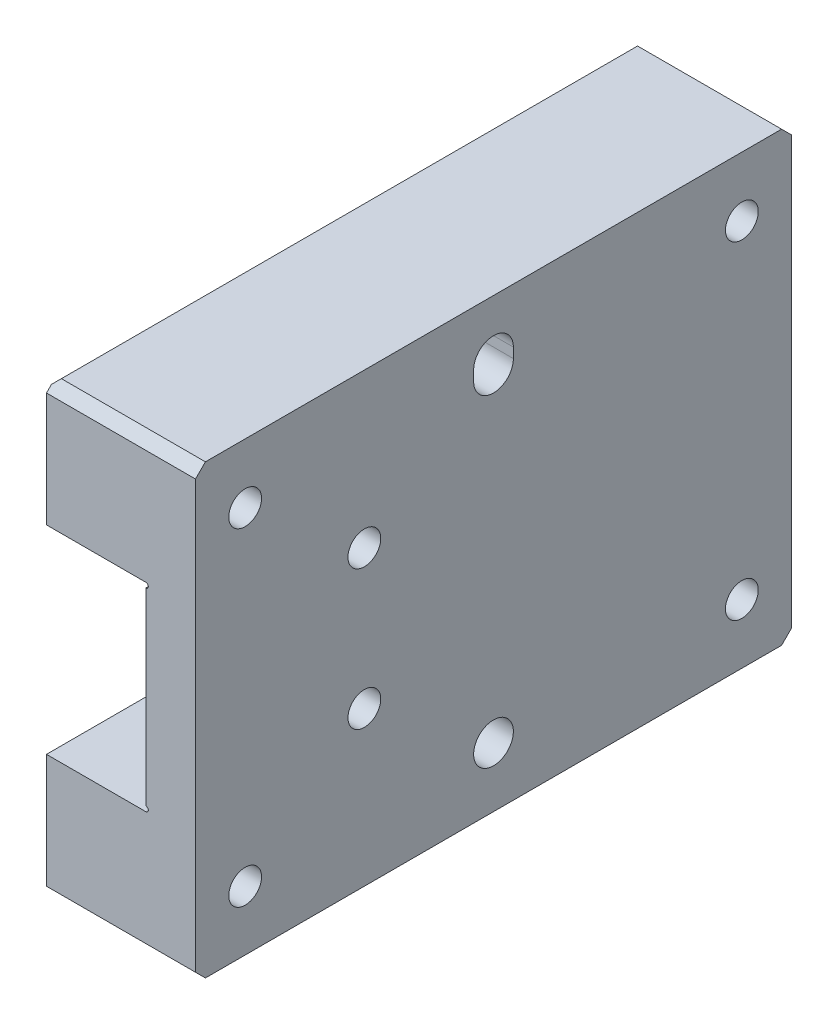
ISO-10303-21;
HEADER;
FILE_DESCRIPTION(('STEP AP214'),'2;1');
FILE_NAME('part.step','',(''),(''),'','','');
FILE_SCHEMA(('AUTOMOTIVE_DESIGN { 1 0 10303 214 1 1 1 1 }'));
ENDSEC;
DATA;
#1=APPLICATION_CONTEXT('core data for automotive mechanical design processes');
#2=APPLICATION_PROTOCOL_DEFINITION('international standard','automotive_design',2000,#1);
#3=PRODUCT_CONTEXT('',#1,'mechanical');
#4=PRODUCT('Part','Part','',(#3));
#5=PRODUCT_RELATED_PRODUCT_CATEGORY('part','',(#4));
#6=PRODUCT_DEFINITION_FORMATION('','',#4);
#7=PRODUCT_DEFINITION_CONTEXT('part definition',#1,'design');
#8=PRODUCT_DEFINITION('design','',#6,#7);
#9=PRODUCT_DEFINITION_SHAPE('','',#8);
#10=(LENGTH_UNIT() NAMED_UNIT(*) SI_UNIT(.MILLI.,.METRE.));
#11=(NAMED_UNIT(*) PLANE_ANGLE_UNIT() SI_UNIT($,.RADIAN.));
#12=(NAMED_UNIT(*) SI_UNIT($,.STERADIAN.) SOLID_ANGLE_UNIT());
#13=UNCERTAINTY_MEASURE_WITH_UNIT(LENGTH_MEASURE(1.E-05),#10,'distance_accuracy_value','');
#14=(GEOMETRIC_REPRESENTATION_CONTEXT(3) GLOBAL_UNCERTAINTY_ASSIGNED_CONTEXT((#13)) GLOBAL_UNIT_ASSIGNED_CONTEXT((#10,
#11,#12)) REPRESENTATION_CONTEXT('',''));
#15=CARTESIAN_POINT('',(0.,0.,0.));
#16=DIRECTION('',(0.,0.,1.));
#17=DIRECTION('',(1.,0.,0.));
#18=AXIS2_PLACEMENT_3D('',#15,#16,#17);
#19=CARTESIAN_POINT('',(-7.5,-22.5,60.));
#20=DIRECTION('',(1.,0.,0.));
#21=DIRECTION('',(0.,0.,-1.));
#22=AXIS2_PLACEMENT_3D('',#19,#20,#21);
#23=PLANE('',#22);
#24=CARTESIAN_POINT('',(-7.5,-16.5,30.));
#25=DIRECTION('',(1.,0.,0.));
#26=DIRECTION('',(0.,0.,-1.));
#27=AXIS2_PLACEMENT_3D('',#24,#25,#26);
#28=CIRCLE('',#27,2.);
#29=CARTESIAN_POINT('',(-7.5,-16.5,28.));
#30=VERTEX_POINT('',#29);
#31=EDGE_CURVE('E224',#30,#30,#28,.T.);
#32=ORIENTED_EDGE('',*,*,#31,.T.);
#33=EDGE_LOOP('',(#32));
#34=FACE_BOUND('',#33,.T.);
#35=CARTESIAN_POINT('',(-7.5,-16.5,55.));
#36=DIRECTION('',(1.,0.,0.));
#37=DIRECTION('',(0.,0.,-1.));
#38=AXIS2_PLACEMENT_3D('',#35,#36,#37);
#39=CIRCLE('',#38,1.65);
#40=CARTESIAN_POINT('',(-7.5,-16.5,53.35));
#41=VERTEX_POINT('',#40);
#42=EDGE_CURVE('E242',#41,#41,#39,.T.);
#43=ORIENTED_EDGE('',*,*,#42,.T.);
#44=EDGE_LOOP('',(#43));
#45=FACE_BOUND('',#44,.T.);
#46=CARTESIAN_POINT('',(-7.5,-16.5,5.));
#47=DIRECTION('',(1.,0.,0.));
#48=DIRECTION('',(0.,0.,-1.));
#49=AXIS2_PLACEMENT_3D('',#46,#47,#48);
#50=CIRCLE('',#49,1.65);
#51=CARTESIAN_POINT('',(-7.5,-16.5,3.35000000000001));
#52=VERTEX_POINT('',#51);
#53=EDGE_CURVE('E248',#52,#52,#50,.T.);
#54=ORIENTED_EDGE('',*,*,#53,.T.);
#55=EDGE_LOOP('',(#54));
#56=FACE_BOUND('',#55,.T.);
#57=DIRECTION('',(0.,-1.,0.));
#58=VECTOR('',#57,1.);
#59=CARTESIAN_POINT('',(-7.5,-22.5,0.));
#60=LINE('',#59,#58);
#61=CARTESIAN_POINT('',(-7.5,-10.,0.));
#62=VERTEX_POINT('',#61);
#63=CARTESIAN_POINT('',(-7.5,-21.5,0.));
#64=VERTEX_POINT('',#63);
#65=EDGE_CURVE('E297',#62,#64,#60,.T.);
#66=ORIENTED_EDGE('',*,*,#65,.T.);
#67=DIRECTION('',(0.,-0.707106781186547,0.707106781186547));
#68=VECTOR('',#67,1.);
#69=CARTESIAN_POINT('',(-7.5,-22.5,1.00000000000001));
#70=LINE('',#69,#68);
#71=CARTESIAN_POINT('',(-7.5,-22.,0.500000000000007));
#72=VERTEX_POINT('',#71);
#73=EDGE_CURVE('E352',#64,#72,#70,.T.);
#74=ORIENTED_EDGE('',*,*,#73,.T.);
#75=DIRECTION('',(0.,0.,1.));
#76=VECTOR('',#75,1.);
#77=CARTESIAN_POINT('',(-7.5,-22.,60.));
#78=LINE('',#77,#76);
#79=CARTESIAN_POINT('',(-7.5,-22.,59.5));
#80=VERTEX_POINT('',#79);
#81=EDGE_CURVE('E307',#72,#80,#78,.T.);
#82=ORIENTED_EDGE('',*,*,#81,.T.);
#83=DIRECTION('',(0.,-0.707106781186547,-0.707106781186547));
#84=VECTOR('',#83,1.);
#85=CARTESIAN_POINT('',(-7.5,-21.5,60.));
#86=LINE('',#85,#84);
#87=CARTESIAN_POINT('',(-7.5,-21.5,60.));
#88=VERTEX_POINT('',#87);
#89=EDGE_CURVE('E51',#80,#88,#86,.F.);
#90=ORIENTED_EDGE('',*,*,#89,.T.);
#91=DIRECTION('',(0.,-1.,0.));
#92=VECTOR('',#91,1.);
#93=CARTESIAN_POINT('',(-7.5,-22.5,60.));
#94=LINE('',#93,#92);
#95=CARTESIAN_POINT('',(-7.5,-10.,60.));
#96=VERTEX_POINT('',#95);
#97=EDGE_CURVE('E290',#96,#88,#94,.T.);
#98=ORIENTED_EDGE('',*,*,#97,.F.);
#99=DIRECTION('',(0.,0.,1.));
#100=VECTOR('',#99,1.);
#101=CARTESIAN_POINT('',(-7.5,-10.,60.));
#102=LINE('',#101,#100);
#103=EDGE_CURVE('E265',#62,#96,#102,.T.);
#104=ORIENTED_EDGE('',*,*,#103,.F.);
#105=EDGE_LOOP('',(#66,#74,#82,#90,#98,#104));
#106=FACE_BOUND('',#105,.T.);
#107=ADVANCED_FACE('F36',(#34,#45,#56,#106),#23,.F.);
#108=CARTESIAN_POINT('',(7.5,-22.5,60.));
#109=DIRECTION('',(-1.,0.,0.));
#110=DIRECTION('',(0.,0.,1.));
#111=AXIS2_PLACEMENT_3D('',#108,#109,#110);
#112=PLANE('',#111);
#113=CARTESIAN_POINT('',(7.5,-6.9999999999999,43.));
#114=DIRECTION('',(1.,0.,0.));
#115=DIRECTION('',(0.,0.,-1.));
#116=AXIS2_PLACEMENT_3D('',#113,#114,#115);
#117=CIRCLE('',#116,1.65);
#118=CARTESIAN_POINT('',(7.5,-6.9999999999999,41.35));
#119=VERTEX_POINT('',#118);
#120=EDGE_CURVE('E690',#119,#119,#117,.T.);
#121=ORIENTED_EDGE('',*,*,#120,.F.);
#122=EDGE_LOOP('',(#121));
#123=FACE_BOUND('',#122,.T.);
#124=CARTESIAN_POINT('',(7.5,6.99999999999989,43.));
#125=DIRECTION('',(1.,0.,0.));
#126=DIRECTION('',(0.,0.,-1.));
#127=AXIS2_PLACEMENT_3D('',#124,#125,#126);
#128=CIRCLE('',#127,1.65);
#129=CARTESIAN_POINT('',(7.5,6.99999999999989,41.35));
#130=VERTEX_POINT('',#129);
#131=EDGE_CURVE('E694',#130,#130,#128,.T.);
#132=ORIENTED_EDGE('',*,*,#131,.F.);
#133=EDGE_LOOP('',(#132));
#134=FACE_BOUND('',#133,.T.);
#135=DIRECTION('',(0.,-1.,0.));
#136=VECTOR('',#135,1.);
#137=CARTESIAN_POINT('',(7.5,17.,32.));
#138=LINE('',#137,#136);
#139=CARTESIAN_POINT('',(7.5,17.,32.));
#140=VERTEX_POINT('',#139);
#141=CARTESIAN_POINT('',(7.5,16.,32.));
#142=VERTEX_POINT('',#141);
#143=EDGE_CURVE('E212',#140,#142,#138,.T.);
#144=ORIENTED_EDGE('',*,*,#143,.F.);
#145=CARTESIAN_POINT('',(7.5,17.,30.));
#146=DIRECTION('',(1.,0.,0.));
#147=DIRECTION('',(0.,0.,-1.));
#148=AXIS2_PLACEMENT_3D('',#145,#146,#147);
#149=CIRCLE('',#148,2.);
#150=CARTESIAN_POINT('',(7.5,17.,28.));
#151=VERTEX_POINT('',#150);
#152=EDGE_CURVE('E196',#151,#140,#149,.T.);
#153=ORIENTED_EDGE('',*,*,#152,.F.);
#154=DIRECTION('',(0.,1.,0.));
#155=VECTOR('',#154,1.);
#156=CARTESIAN_POINT('',(7.5,17.,28.));
#157=LINE('',#156,#155);
#158=CARTESIAN_POINT('',(7.5,16.,28.));
#159=VERTEX_POINT('',#158);
#160=EDGE_CURVE('E201',#159,#151,#157,.T.);
#161=ORIENTED_EDGE('',*,*,#160,.F.);
#162=CARTESIAN_POINT('',(7.5,16.,30.));
#163=DIRECTION('',(1.,0.,0.));
#164=DIRECTION('',(0.,0.,-1.));
#165=AXIS2_PLACEMENT_3D('',#162,#163,#164);
#166=CIRCLE('',#165,2.);
#167=EDGE_CURVE('E203',#142,#159,#166,.T.);
#168=ORIENTED_EDGE('',*,*,#167,.F.);
#169=EDGE_LOOP('',(#144,#153,#161,#168));
#170=FACE_BOUND('',#169,.T.);
#171=CARTESIAN_POINT('',(7.5,-16.5,30.));
#172=DIRECTION('',(1.,0.,0.));
#173=DIRECTION('',(0.,0.,-1.));
#174=AXIS2_PLACEMENT_3D('',#171,#172,#173);
#175=CIRCLE('',#174,2.);
#176=CARTESIAN_POINT('',(7.5,-16.5,28.));
#177=VERTEX_POINT('',#176);
#178=EDGE_CURVE('E218',#177,#177,#175,.T.);
#179=ORIENTED_EDGE('',*,*,#178,.F.);
#180=EDGE_LOOP('',(#179));
#181=FACE_BOUND('',#180,.T.);
#182=CARTESIAN_POINT('',(7.5,16.5,55.));
#183=DIRECTION('',(1.,0.,0.));
#184=DIRECTION('',(0.,0.,-1.));
#185=AXIS2_PLACEMENT_3D('',#182,#183,#184);
#186=CIRCLE('',#185,1.65);
#187=CARTESIAN_POINT('',(7.5,16.5,53.35));
#188=VERTEX_POINT('',#187);
#189=EDGE_CURVE('E227',#188,#188,#186,.T.);
#190=ORIENTED_EDGE('',*,*,#189,.F.);
#191=EDGE_LOOP('',(#190));
#192=FACE_BOUND('',#191,.T.);
#193=CARTESIAN_POINT('',(7.5,16.5,4.99999999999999));
#194=DIRECTION('',(1.,0.,0.));
#195=DIRECTION('',(0.,0.,-1.));
#196=AXIS2_PLACEMENT_3D('',#193,#194,#195);
#197=CIRCLE('',#196,1.65);
#198=CARTESIAN_POINT('',(7.5,16.5,3.34999999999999));
#199=VERTEX_POINT('',#198);
#200=EDGE_CURVE('E233',#199,#199,#197,.T.);
#201=ORIENTED_EDGE('',*,*,#200,.F.);
#202=EDGE_LOOP('',(#201));
#203=FACE_BOUND('',#202,.T.);
#204=CARTESIAN_POINT('',(7.5,-16.5,55.));
#205=DIRECTION('',(1.,0.,0.));
#206=DIRECTION('',(0.,0.,-1.));
#207=AXIS2_PLACEMENT_3D('',#204,#205,#206);
#208=CIRCLE('',#207,1.65);
#209=CARTESIAN_POINT('',(7.5,-16.5,53.35));
#210=VERTEX_POINT('',#209);
#211=EDGE_CURVE('E239',#210,#210,#208,.T.);
#212=ORIENTED_EDGE('',*,*,#211,.F.);
#213=EDGE_LOOP('',(#212));
#214=FACE_BOUND('',#213,.T.);
#215=CARTESIAN_POINT('',(7.5,-16.5,5.));
#216=DIRECTION('',(1.,0.,0.));
#217=DIRECTION('',(0.,0.,-1.));
#218=AXIS2_PLACEMENT_3D('',#215,#216,#217);
#219=CIRCLE('',#218,1.65);
#220=CARTESIAN_POINT('',(7.5,-16.5,3.35000000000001));
#221=VERTEX_POINT('',#220);
#222=EDGE_CURVE('E245',#221,#221,#219,.T.);
#223=ORIENTED_EDGE('',*,*,#222,.F.);
#224=EDGE_LOOP('',(#223));
#225=FACE_BOUND('',#224,.T.);
#226=DIRECTION('',(0.,1.,0.));
#227=VECTOR('',#226,1.);
#228=CARTESIAN_POINT('',(7.5,-22.5,0.));
#229=LINE('',#228,#227);
#230=CARTESIAN_POINT('',(7.5,-21.5,0.));
#231=VERTEX_POINT('',#230);
#232=CARTESIAN_POINT('',(7.5,21.5,0.));
#233=VERTEX_POINT('',#232);
#234=EDGE_CURVE('E279',#231,#233,#229,.T.);
#235=ORIENTED_EDGE('',*,*,#234,.T.);
#236=DIRECTION('',(0.,0.707106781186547,0.707106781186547));
#237=VECTOR('',#236,1.);
#238=CARTESIAN_POINT('',(7.5,22.5,1.00000000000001));
#239=LINE('',#238,#237);
#240=CARTESIAN_POINT('',(7.5,22.5,1.00000000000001));
#241=VERTEX_POINT('',#240);
#242=EDGE_CURVE('E344',#233,#241,#239,.T.);
#243=ORIENTED_EDGE('',*,*,#242,.T.);
#244=DIRECTION('',(0.,0.,-1.));
#245=VECTOR('',#244,1.);
#246=CARTESIAN_POINT('',(7.5,22.5,60.));
#247=LINE('',#246,#245);
#248=CARTESIAN_POINT('',(7.5,22.5,59.));
#249=VERTEX_POINT('',#248);
#250=EDGE_CURVE('E301',#249,#241,#247,.T.);
#251=ORIENTED_EDGE('',*,*,#250,.F.);
#252=DIRECTION('',(0.,0.707106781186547,-0.707106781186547));
#253=VECTOR('',#252,1.);
#254=CARTESIAN_POINT('',(7.5,21.5,60.));
#255=LINE('',#254,#253);
#256=CARTESIAN_POINT('',(7.5,21.5,60.));
#257=VERTEX_POINT('',#256);
#258=EDGE_CURVE('E338',#249,#257,#255,.F.);
#259=ORIENTED_EDGE('',*,*,#258,.T.);
#260=DIRECTION('',(0.,1.,0.));
#261=VECTOR('',#260,1.);
#262=CARTESIAN_POINT('',(7.5,-22.5,60.));
#263=LINE('',#262,#261);
#264=CARTESIAN_POINT('',(7.5,-21.5,60.));
#265=VERTEX_POINT('',#264);
#266=EDGE_CURVE('E287',#265,#257,#263,.T.);
#267=ORIENTED_EDGE('',*,*,#266,.F.);
#268=DIRECTION('',(0.,0.707106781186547,0.707106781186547));
#269=VECTOR('',#268,1.);
#270=CARTESIAN_POINT('',(7.5,-21.5,60.));
#271=LINE('',#270,#269);
#272=CARTESIAN_POINT('',(7.5,-22.5,59.));
#273=VERTEX_POINT('',#272);
#274=EDGE_CURVE('E340',#265,#273,#271,.F.);
#275=ORIENTED_EDGE('',*,*,#274,.T.);
#276=DIRECTION('',(0.,0.,-1.));
#277=VECTOR('',#276,1.);
#278=CARTESIAN_POINT('',(7.5,-22.5,60.));
#279=LINE('',#278,#277);
#280=CARTESIAN_POINT('',(7.5,-22.5,1.00000000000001));
#281=VERTEX_POINT('',#280);
#282=EDGE_CURVE('E294',#273,#281,#279,.T.);
#283=ORIENTED_EDGE('',*,*,#282,.T.);
#284=DIRECTION('',(0.,0.707106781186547,-0.707106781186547));
#285=VECTOR('',#284,1.);
#286=CARTESIAN_POINT('',(7.5,-22.5,1.00000000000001));
#287=LINE('',#286,#285);
#288=EDGE_CURVE('E342',#281,#231,#287,.T.);
#289=ORIENTED_EDGE('',*,*,#288,.T.);
#290=EDGE_LOOP('',(#235,#243,#251,#259,#267,#275,#283,#289));
#291=FACE_BOUND('',#290,.T.);
#292=ADVANCED_FACE('F410',(#123,#134,#170,#181,#192,#203,#214,#225,#291),#112,.F.);
#293=CARTESIAN_POINT('',(-7.5,22.5,60.));
#294=DIRECTION('',(0.,-1.,0.));
#295=DIRECTION('',(0.,0.,-1.));
#296=AXIS2_PLACEMENT_3D('',#293,#294,#295);
#297=PLANE('',#296);
#298=ORIENTED_EDGE('',*,*,#250,.T.);
#299=DIRECTION('',(-1.,0.,0.));
#300=VECTOR('',#299,1.);
#301=CARTESIAN_POINT('',(-7.,22.5,1.00000000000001));
#302=LINE('',#301,#300);
#303=CARTESIAN_POINT('',(-7.,22.5,1.00000000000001));
#304=VERTEX_POINT('',#303);
#305=EDGE_CURVE('E323',#241,#304,#302,.T.);
#306=ORIENTED_EDGE('',*,*,#305,.T.);
#307=DIRECTION('',(0.,0.,1.));
#308=VECTOR('',#307,1.);
#309=CARTESIAN_POINT('',(-7.,22.5,60.));
#310=LINE('',#309,#308);
#311=CARTESIAN_POINT('',(-7.,22.5,59.));
#312=VERTEX_POINT('',#311);
#313=EDGE_CURVE('E312',#304,#312,#310,.T.);
#314=ORIENTED_EDGE('',*,*,#313,.T.);
#315=DIRECTION('',(1.,0.,0.));
#316=VECTOR('',#315,1.);
#317=CARTESIAN_POINT('',(-7.5,22.5,59.));
#318=LINE('',#317,#316);
#319=EDGE_CURVE('E321',#312,#249,#318,.T.);
#320=ORIENTED_EDGE('',*,*,#319,.T.);
#321=EDGE_LOOP('',(#298,#306,#314,#320));
#322=FACE_BOUND('',#321,.T.);
#323=ADVANCED_FACE('F415',(#322),#297,.F.);
#324=CARTESIAN_POINT('',(-7.5,16.,30.));
#325=DIRECTION('',(1.,0.,0.));
#326=DIRECTION('',(0.,0.,-1.));
#327=AXIS2_PLACEMENT_3D('',#324,#325,#326);
#328=CIRCLE('',#327,2.);
#329=CARTESIAN_POINT('',(-7.5,16.,32.));
#330=VERTEX_POINT('',#329);
#331=CARTESIAN_POINT('',(-7.5,16.,28.));
#332=VERTEX_POINT('',#331);
#333=EDGE_CURVE('E186',#330,#332,#328,.T.);
#334=ORIENTED_EDGE('',*,*,#333,.T.);
#335=DIRECTION('',(0.,1.,0.));
#336=VECTOR('',#335,1.);
#337=CARTESIAN_POINT('',(-7.5,17.,28.));
#338=LINE('',#337,#336);
#339=CARTESIAN_POINT('',(-7.5,17.,28.));
#340=VERTEX_POINT('',#339);
#341=EDGE_CURVE('E197',#332,#340,#338,.T.);
#342=ORIENTED_EDGE('',*,*,#341,.T.);
#343=CARTESIAN_POINT('',(-7.5,17.,30.));
#344=DIRECTION('',(1.,0.,0.));
#345=DIRECTION('',(0.,0.,-1.));
#346=AXIS2_PLACEMENT_3D('',#343,#344,#345);
#347=CIRCLE('',#346,2.);
#348=CARTESIAN_POINT('',(-7.5,17.,32.));
#349=VERTEX_POINT('',#348);
#350=EDGE_CURVE('E187',#340,#349,#347,.T.);
#351=ORIENTED_EDGE('',*,*,#350,.T.);
#352=DIRECTION('',(0.,-1.,0.));
#353=VECTOR('',#352,1.);
#354=CARTESIAN_POINT('',(-7.5,17.,32.));
#355=LINE('',#354,#353);
#356=EDGE_CURVE('E177',#349,#330,#355,.T.);
#357=ORIENTED_EDGE('',*,*,#356,.T.);
#358=EDGE_LOOP('',(#334,#342,#351,#357));
#359=FACE_BOUND('',#358,.T.);
#360=CARTESIAN_POINT('',(-7.5,16.5,55.));
#361=DIRECTION('',(1.,0.,0.));
#362=DIRECTION('',(0.,0.,-1.));
#363=AXIS2_PLACEMENT_3D('',#360,#361,#362);
#364=CIRCLE('',#363,1.65);
#365=CARTESIAN_POINT('',(-7.5,16.5,53.35));
#366=VERTEX_POINT('',#365);
#367=EDGE_CURVE('E230',#366,#366,#364,.T.);
#368=ORIENTED_EDGE('',*,*,#367,.T.);
#369=EDGE_LOOP('',(#368));
#370=FACE_BOUND('',#369,.T.);
#371=CARTESIAN_POINT('',(-7.5,16.5,4.99999999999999));
#372=DIRECTION('',(1.,0.,0.));
#373=DIRECTION('',(0.,0.,-1.));
#374=AXIS2_PLACEMENT_3D('',#371,#372,#373);
#375=CIRCLE('',#374,1.65);
#376=CARTESIAN_POINT('',(-7.5,16.5,3.34999999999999));
#377=VERTEX_POINT('',#376);
#378=EDGE_CURVE('E236',#377,#377,#375,.T.);
#379=ORIENTED_EDGE('',*,*,#378,.T.);
#380=EDGE_LOOP('',(#379));
#381=FACE_BOUND('',#380,.T.);
#382=DIRECTION('',(0.,0.,-1.));
#383=VECTOR('',#382,1.);
#384=CARTESIAN_POINT('',(-7.5,22.,60.));
#385=LINE('',#384,#383);
#386=CARTESIAN_POINT('',(-7.5,22.,59.5));
#387=VERTEX_POINT('',#386);
#388=CARTESIAN_POINT('',(-7.5,22.,0.500000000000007));
#389=VERTEX_POINT('',#388);
#390=EDGE_CURVE('E309',#387,#389,#385,.T.);
#391=ORIENTED_EDGE('',*,*,#390,.T.);
#392=DIRECTION('',(0.,-0.707106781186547,-0.707106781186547));
#393=VECTOR('',#392,1.);
#394=CARTESIAN_POINT('',(-7.5,22.5,1.00000000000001));
#395=LINE('',#394,#393);
#396=CARTESIAN_POINT('',(-7.5,21.5,0.));
#397=VERTEX_POINT('',#396);
#398=EDGE_CURVE('E332',#389,#397,#395,.T.);
#399=ORIENTED_EDGE('',*,*,#398,.T.);
#400=CARTESIAN_POINT('',(-7.5,9.99999999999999,0.));
#401=VERTEX_POINT('',#400);
#402=EDGE_CURVE('E291',#397,#401,#60,.T.);
#403=ORIENTED_EDGE('',*,*,#402,.T.);
#404=DIRECTION('',(0.,0.,-1.));
#405=VECTOR('',#404,1.);
#406=CARTESIAN_POINT('',(-7.5,10.,60.));
#407=LINE('',#406,#405);
#408=CARTESIAN_POINT('',(-7.5,10.,60.));
#409=VERTEX_POINT('',#408);
#410=EDGE_CURVE('E260',#409,#401,#407,.T.);
#411=ORIENTED_EDGE('',*,*,#410,.F.);
#412=CARTESIAN_POINT('',(-7.5,21.5,60.));
#413=VERTEX_POINT('',#412);
#414=EDGE_CURVE('E292',#413,#409,#94,.T.);
#415=ORIENTED_EDGE('',*,*,#414,.F.);
#416=DIRECTION('',(0.,-0.707106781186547,0.707106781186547));
#417=VECTOR('',#416,1.);
#418=CARTESIAN_POINT('',(-7.5,21.5,60.));
#419=LINE('',#418,#417);
#420=EDGE_CURVE('E330',#413,#387,#419,.F.);
#421=ORIENTED_EDGE('',*,*,#420,.T.);
#422=EDGE_LOOP('',(#391,#399,#403,#411,#415,#421));
#423=FACE_BOUND('',#422,.T.);
#424=ADVANCED_FACE('F199',(#359,#370,#381,#423),#23,.F.);
#425=CARTESIAN_POINT('',(-7.5,-22.5,60.));
#426=DIRECTION('',(0.,1.,0.));
#427=DIRECTION('',(0.,0.,1.));
#428=AXIS2_PLACEMENT_3D('',#425,#426,#427);
#429=PLANE('',#428);
#430=DIRECTION('',(0.,0.,-1.));
#431=VECTOR('',#430,1.);
#432=CARTESIAN_POINT('',(-7.00000000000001,-22.5,60.));
#433=LINE('',#432,#431);
#434=CARTESIAN_POINT('',(-7.00000000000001,-22.5,59.));
#435=VERTEX_POINT('',#434);
#436=CARTESIAN_POINT('',(-7.00000000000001,-22.5,1.00000000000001));
#437=VERTEX_POINT('',#436);
#438=EDGE_CURVE('E304',#435,#437,#433,.T.);
#439=ORIENTED_EDGE('',*,*,#438,.T.);
#440=DIRECTION('',(1.,0.,0.));
#441=VECTOR('',#440,1.);
#442=CARTESIAN_POINT('',(7.5,-22.5,1.00000000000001));
#443=LINE('',#442,#441);
#444=EDGE_CURVE('E348',#437,#281,#443,.T.);
#445=ORIENTED_EDGE('',*,*,#444,.T.);
#446=ORIENTED_EDGE('',*,*,#282,.F.);
#447=DIRECTION('',(-1.,0.,0.));
#448=VECTOR('',#447,1.);
#449=CARTESIAN_POINT('',(-7.5,-22.5,59.));
#450=LINE('',#449,#448);
#451=EDGE_CURVE('E346',#273,#435,#450,.T.);
#452=ORIENTED_EDGE('',*,*,#451,.T.);
#453=EDGE_LOOP('',(#439,#445,#446,#452));
#454=FACE_BOUND('',#453,.T.);
#455=ADVANCED_FACE('F403',(#454),#429,.F.);
#456=CARTESIAN_POINT('',(0.,0.,60.));
#457=DIRECTION('',(0.,0.,-1.));
#458=DIRECTION('',(-1.,0.,0.));
#459=AXIS2_PLACEMENT_3D('',#456,#457,#458);
#460=PLANE('',#459);
#461=ORIENTED_EDGE('',*,*,#97,.T.);
#462=DIRECTION('',(1.,0.,0.));
#463=VECTOR('',#462,1.);
#464=CARTESIAN_POINT('',(0.,-21.5,60.));
#465=LINE('',#464,#463);
#466=EDGE_CURVE('E11',#88,#265,#465,.T.);
#467=ORIENTED_EDGE('',*,*,#466,.T.);
#468=ORIENTED_EDGE('',*,*,#266,.T.);
#469=DIRECTION('',(-1.,0.,0.));
#470=VECTOR('',#469,1.);
#471=CARTESIAN_POINT('',(0.,21.5,60.));
#472=LINE('',#471,#470);
#473=EDGE_CURVE('E44',#257,#413,#472,.T.);
#474=ORIENTED_EDGE('',*,*,#473,.T.);
#475=ORIENTED_EDGE('',*,*,#414,.T.);
#476=DIRECTION('',(-1.,0.,0.));
#477=VECTOR('',#476,1.);
#478=CARTESIAN_POINT('',(2.5,10.,60.));
#479=LINE('',#478,#477);
#480=CARTESIAN_POINT('',(2.5,10.,60.));
#481=VERTEX_POINT('',#480);
#482=EDGE_CURVE('E272',#481,#409,#479,.T.);
#483=ORIENTED_EDGE('',*,*,#482,.F.);
#484=CARTESIAN_POINT('',(2.5,9.75,60.));
#485=DIRECTION('',(0.,0.,1.));
#486=DIRECTION('',(1.,0.,0.));
#487=AXIS2_PLACEMENT_3D('',#484,#485,#486);
#488=CIRCLE('',#487,0.25);
#489=CARTESIAN_POINT('',(2.5,9.5,60.));
#490=VERTEX_POINT('',#489);
#491=EDGE_CURVE('E255',#490,#481,#488,.T.);
#492=ORIENTED_EDGE('',*,*,#491,.F.);
#493=DIRECTION('',(0.,1.,0.));
#494=VECTOR('',#493,1.);
#495=CARTESIAN_POINT('',(2.5,10.,60.));
#496=LINE('',#495,#494);
#497=CARTESIAN_POINT('',(2.5,-9.5,60.));
#498=VERTEX_POINT('',#497);
#499=EDGE_CURVE('E262',#498,#490,#496,.T.);
#500=ORIENTED_EDGE('',*,*,#499,.F.);
#501=CARTESIAN_POINT('',(2.5,-9.75,60.));
#502=DIRECTION('',(0.,0.,1.));
#503=DIRECTION('',(1.,0.,0.));
#504=AXIS2_PLACEMENT_3D('',#501,#502,#503);
#505=CIRCLE('',#504,0.25);
#506=CARTESIAN_POINT('',(2.5,-10.,60.));
#507=VERTEX_POINT('',#506);
#508=EDGE_CURVE('E251',#507,#498,#505,.T.);
#509=ORIENTED_EDGE('',*,*,#508,.F.);
#510=DIRECTION('',(-1.,0.,0.));
#511=VECTOR('',#510,1.);
#512=CARTESIAN_POINT('',(2.5,-10.,60.));
#513=LINE('',#512,#511);
#514=EDGE_CURVE('E276',#507,#96,#513,.T.);
#515=ORIENTED_EDGE('',*,*,#514,.T.);
#516=EDGE_LOOP('',(#461,#467,#468,#474,#475,#483,#492,#500,#509,#515));
#517=FACE_BOUND('',#516,.T.);
#518=ADVANCED_FACE('F360',(#517),#460,.F.);
#519=CARTESIAN_POINT('',(0.,0.,0.));
#520=DIRECTION('',(0.,0.,-1.));
#521=DIRECTION('',(-1.,0.,0.));
#522=AXIS2_PLACEMENT_3D('',#519,#520,#521);
#523=PLANE('',#522);
#524=ORIENTED_EDGE('',*,*,#402,.F.);
#525=DIRECTION('',(1.,0.,0.));
#526=VECTOR('',#525,1.);
#527=CARTESIAN_POINT('',(7.5,21.5,0.));
#528=LINE('',#527,#526);
#529=EDGE_CURVE('E336',#397,#233,#528,.T.);
#530=ORIENTED_EDGE('',*,*,#529,.T.);
#531=ORIENTED_EDGE('',*,*,#234,.F.);
#532=DIRECTION('',(-1.,0.,0.));
#533=VECTOR('',#532,1.);
#534=CARTESIAN_POINT('',(-7.00000000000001,-21.5,0.));
#535=LINE('',#534,#533);
#536=EDGE_CURVE('E334',#231,#64,#535,.T.);
#537=ORIENTED_EDGE('',*,*,#536,.T.);
#538=ORIENTED_EDGE('',*,*,#65,.F.);
#539=DIRECTION('',(-1.,0.,0.));
#540=VECTOR('',#539,1.);
#541=CARTESIAN_POINT('',(2.5,-10.,0.));
#542=LINE('',#541,#540);
#543=CARTESIAN_POINT('',(2.5,-10.,0.));
#544=VERTEX_POINT('',#543);
#545=EDGE_CURVE('E280',#544,#62,#542,.T.);
#546=ORIENTED_EDGE('',*,*,#545,.F.);
#547=CARTESIAN_POINT('',(2.5,-9.75,0.));
#548=DIRECTION('',(0.,0.,1.));
#549=DIRECTION('',(1.,0.,0.));
#550=AXIS2_PLACEMENT_3D('',#547,#548,#549);
#551=CIRCLE('',#550,0.25);
#552=CARTESIAN_POINT('',(2.5,-9.5,0.));
#553=VERTEX_POINT('',#552);
#554=EDGE_CURVE('E252',#544,#553,#551,.T.);
#555=ORIENTED_EDGE('',*,*,#554,.T.);
#556=DIRECTION('',(0.,-1.,0.));
#557=VECTOR('',#556,1.);
#558=CARTESIAN_POINT('',(2.5,9.99999999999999,0.));
#559=LINE('',#558,#557);
#560=CARTESIAN_POINT('',(2.5,9.5,0.));
#561=VERTEX_POINT('',#560);
#562=EDGE_CURVE('E267',#561,#553,#559,.T.);
#563=ORIENTED_EDGE('',*,*,#562,.F.);
#564=CARTESIAN_POINT('',(2.5,9.75,0.));
#565=DIRECTION('',(0.,0.,1.));
#566=DIRECTION('',(1.,0.,0.));
#567=AXIS2_PLACEMENT_3D('',#564,#565,#566);
#568=CIRCLE('',#567,0.25);
#569=CARTESIAN_POINT('',(2.5,10.,0.));
#570=VERTEX_POINT('',#569);
#571=EDGE_CURVE('E257',#561,#570,#568,.T.);
#572=ORIENTED_EDGE('',*,*,#571,.T.);
#573=DIRECTION('',(-1.,0.,0.));
#574=VECTOR('',#573,1.);
#575=CARTESIAN_POINT('',(2.5,9.99999999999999,0.));
#576=LINE('',#575,#574);
#577=EDGE_CURVE('E282',#570,#401,#576,.T.);
#578=ORIENTED_EDGE('',*,*,#577,.T.);
#579=EDGE_LOOP('',(#524,#530,#531,#537,#538,#546,#555,#563,#572,#578));
#580=FACE_BOUND('',#579,.T.);
#581=ADVANCED_FACE('F374',(#580),#523,.T.);
#582=CARTESIAN_POINT('',(2.5,-10.,60.));
#583=DIRECTION('',(0.,-1.,0.));
#584=DIRECTION('',(0.,0.,-1.));
#585=AXIS2_PLACEMENT_3D('',#582,#583,#584);
#586=PLANE('',#585);
#587=ORIENTED_EDGE('',*,*,#103,.T.);
#588=ORIENTED_EDGE('',*,*,#514,.F.);
#589=DIRECTION('',(0.,0.,1.));
#590=VECTOR('',#589,1.);
#591=CARTESIAN_POINT('',(2.5,-10.,60.));
#592=LINE('',#591,#590);
#593=EDGE_CURVE('E270',#544,#507,#592,.T.);
#594=ORIENTED_EDGE('',*,*,#593,.F.);
#595=ORIENTED_EDGE('',*,*,#545,.T.);
#596=EDGE_LOOP('',(#587,#588,#594,#595));
#597=FACE_BOUND('',#596,.T.);
#598=ADVANCED_FACE('F389',(#597),#586,.F.);
#599=CARTESIAN_POINT('',(2.5,10.,60.));
#600=DIRECTION('',(0.,1.,0.));
#601=DIRECTION('',(0.,0.,1.));
#602=AXIS2_PLACEMENT_3D('',#599,#600,#601);
#603=PLANE('',#602);
#604=ORIENTED_EDGE('',*,*,#410,.T.);
#605=ORIENTED_EDGE('',*,*,#577,.F.);
#606=DIRECTION('',(0.,0.,-1.));
#607=VECTOR('',#606,1.);
#608=CARTESIAN_POINT('',(2.5,10.,60.));
#609=LINE('',#608,#607);
#610=EDGE_CURVE('E264',#481,#570,#609,.T.);
#611=ORIENTED_EDGE('',*,*,#610,.F.);
#612=ORIENTED_EDGE('',*,*,#482,.T.);
#613=EDGE_LOOP('',(#604,#605,#611,#612));
#614=FACE_BOUND('',#613,.T.);
#615=ADVANCED_FACE('F371',(#614),#603,.F.);
#616=CARTESIAN_POINT('',(2.5,0.,0.));
#617=DIRECTION('',(1.,0.,0.));
#618=DIRECTION('',(0.,0.,-1.));
#619=AXIS2_PLACEMENT_3D('',#616,#617,#618);
#620=PLANE('',#619);
#621=CARTESIAN_POINT('',(2.5,-6.9999999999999,43.));
#622=DIRECTION('',(1.,0.,0.));
#623=DIRECTION('',(0.,0.,-1.));
#624=AXIS2_PLACEMENT_3D('',#621,#622,#623);
#625=CIRCLE('',#624,1.65);
#626=CARTESIAN_POINT('',(2.5,-6.9999999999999,41.35));
#627=VERTEX_POINT('',#626);
#628=EDGE_CURVE('E693',#627,#627,#625,.T.);
#629=ORIENTED_EDGE('',*,*,#628,.T.);
#630=EDGE_LOOP('',(#629));
#631=FACE_BOUND('',#630,.T.);
#632=CARTESIAN_POINT('',(2.5,6.99999999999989,43.));
#633=DIRECTION('',(1.,0.,0.));
#634=DIRECTION('',(0.,0.,-1.));
#635=AXIS2_PLACEMENT_3D('',#632,#633,#634);
#636=CIRCLE('',#635,1.65);
#637=CARTESIAN_POINT('',(2.5,6.99999999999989,41.35));
#638=VERTEX_POINT('',#637);
#639=EDGE_CURVE('E206',#638,#638,#636,.T.);
#640=ORIENTED_EDGE('',*,*,#639,.T.);
#641=EDGE_LOOP('',(#640));
#642=FACE_BOUND('',#641,.T.);
#643=ORIENTED_EDGE('',*,*,#562,.T.);
#644=DIRECTION('',(0.,0.,1.));
#645=VECTOR('',#644,1.);
#646=CARTESIAN_POINT('',(2.5,-9.5,0.));
#647=LINE('',#646,#645);
#648=EDGE_CURVE('E318',#553,#498,#647,.T.);
#649=ORIENTED_EDGE('',*,*,#648,.T.);
#650=ORIENTED_EDGE('',*,*,#499,.T.);
#651=DIRECTION('',(0.,0.,1.));
#652=VECTOR('',#651,1.);
#653=CARTESIAN_POINT('',(2.5,9.5,0.));
#654=LINE('',#653,#652);
#655=EDGE_CURVE('E315',#490,#561,#654,.F.);
#656=ORIENTED_EDGE('',*,*,#655,.T.);
#657=EDGE_LOOP('',(#643,#649,#650,#656));
#658=FACE_BOUND('',#657,.T.);
#659=ADVANCED_FACE('F382',(#631,#642,#658),#620,.F.);
#660=CARTESIAN_POINT('',(-7.00000000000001,-22.5,60.));
#661=DIRECTION('',(0.707106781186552,0.707106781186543,0.));
#662=DIRECTION('',(0.,0.,-1.));
#663=AXIS2_PLACEMENT_3D('',#660,#661,#662);
#664=PLANE('',#663);
#665=ORIENTED_EDGE('',*,*,#81,.F.);
#666=DIRECTION('',(-0.57735026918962,0.577350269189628,-0.577350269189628));
#667=VECTOR('',#666,1.);
#668=CARTESIAN_POINT('',(12.6666666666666,-42.1666666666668,20.6666666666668));
#669=LINE('',#668,#667);
#670=EDGE_CURVE('E355',#72,#437,#669,.F.);
#671=ORIENTED_EDGE('',*,*,#670,.T.);
#672=ORIENTED_EDGE('',*,*,#438,.F.);
#673=DIRECTION('',(-0.57735026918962,0.577350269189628,0.577350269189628));
#674=VECTOR('',#673,1.);
#675=CARTESIAN_POINT('',(-7.33333333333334,-22.1666666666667,59.3333333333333));
#676=LINE('',#675,#674);
#677=EDGE_CURVE('E59',#435,#80,#676,.T.);
#678=ORIENTED_EDGE('',*,*,#677,.T.);
#679=EDGE_LOOP('',(#665,#671,#672,#678));
#680=FACE_BOUND('',#679,.T.);
#681=ADVANCED_FACE('F401',(#680),#664,.F.);
#682=CARTESIAN_POINT('',(-7.5,22.,60.));
#683=DIRECTION('',(0.707106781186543,-0.707106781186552,0.));
#684=DIRECTION('',(0.,0.,-1.));
#685=AXIS2_PLACEMENT_3D('',#682,#683,#684);
#686=PLANE('',#685);
#687=ORIENTED_EDGE('',*,*,#313,.F.);
#688=DIRECTION('',(0.577350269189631,0.577350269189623,0.577350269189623));
#689=VECTOR('',#688,1.);
#690=CARTESIAN_POINT('',(12.3333333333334,41.8333333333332,20.3333333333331));
#691=LINE('',#690,#689);
#692=EDGE_CURVE('E328',#304,#389,#691,.F.);
#693=ORIENTED_EDGE('',*,*,#692,.T.);
#694=ORIENTED_EDGE('',*,*,#390,.F.);
#695=DIRECTION('',(0.577350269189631,0.577350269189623,-0.577350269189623));
#696=VECTOR('',#695,1.);
#697=CARTESIAN_POINT('',(-7.66666666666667,21.8333333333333,59.6666666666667));
#698=LINE('',#697,#696);
#699=EDGE_CURVE('E326',#387,#312,#698,.T.);
#700=ORIENTED_EDGE('',*,*,#699,.T.);
#701=EDGE_LOOP('',(#687,#693,#694,#700));
#702=FACE_BOUND('',#701,.T.);
#703=ADVANCED_FACE('F419',(#702),#686,.F.);
#704=CARTESIAN_POINT('',(2.5,9.75,0.));
#705=DIRECTION('',(0.,0.,1.));
#706=DIRECTION('',(1.,0.,0.));
#707=AXIS2_PLACEMENT_3D('',#704,#705,#706);
#708=CYLINDRICAL_SURFACE('',#707,0.25);
#709=ORIENTED_EDGE('',*,*,#571,.F.);
#710=ORIENTED_EDGE('',*,*,#655,.F.);
#711=ORIENTED_EDGE('',*,*,#491,.T.);
#712=ORIENTED_EDGE('',*,*,#610,.T.);
#713=EDGE_LOOP('',(#709,#710,#711,#712));
#714=FACE_BOUND('',#713,.T.);
#715=ADVANCED_FACE('F379',(#714),#708,.F.);
#716=CARTESIAN_POINT('',(2.5,-9.75,0.));
#717=DIRECTION('',(0.,0.,1.));
#718=DIRECTION('',(1.,0.,0.));
#719=AXIS2_PLACEMENT_3D('',#716,#717,#718);
#720=CYLINDRICAL_SURFACE('',#719,0.25);
#721=ORIENTED_EDGE('',*,*,#554,.F.);
#722=ORIENTED_EDGE('',*,*,#593,.T.);
#723=ORIENTED_EDGE('',*,*,#508,.T.);
#724=ORIENTED_EDGE('',*,*,#648,.F.);
#725=EDGE_LOOP('',(#721,#722,#723,#724));
#726=FACE_BOUND('',#725,.T.);
#727=ADVANCED_FACE('F459',(#726),#720,.F.);
#728=CARTESIAN_POINT('',(7.5,-16.5,5.));
#729=DIRECTION('',(1.,0.,0.));
#730=DIRECTION('',(0.,0.,-1.));
#731=AXIS2_PLACEMENT_3D('',#728,#729,#730);
#732=CYLINDRICAL_SURFACE('',#731,1.65);
#733=ORIENTED_EDGE('',*,*,#53,.F.);
#734=EDGE_LOOP('',(#733));
#735=FACE_BOUND('',#734,.T.);
#736=ORIENTED_EDGE('',*,*,#222,.T.);
#737=EDGE_LOOP('',(#736));
#738=FACE_BOUND('',#737,.T.);
#739=ADVANCED_FACE('F464',(#735,#738),#732,.F.);
#740=CARTESIAN_POINT('',(7.5,-16.5,55.));
#741=DIRECTION('',(1.,0.,0.));
#742=DIRECTION('',(0.,0.,-1.));
#743=AXIS2_PLACEMENT_3D('',#740,#741,#742);
#744=CYLINDRICAL_SURFACE('',#743,1.65);
#745=ORIENTED_EDGE('',*,*,#42,.F.);
#746=EDGE_LOOP('',(#745));
#747=FACE_BOUND('',#746,.T.);
#748=ORIENTED_EDGE('',*,*,#211,.T.);
#749=EDGE_LOOP('',(#748));
#750=FACE_BOUND('',#749,.T.);
#751=ADVANCED_FACE('F630',(#747,#750),#744,.F.);
#752=CARTESIAN_POINT('',(7.5,16.5,4.99999999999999));
#753=DIRECTION('',(1.,0.,0.));
#754=DIRECTION('',(0.,0.,-1.));
#755=AXIS2_PLACEMENT_3D('',#752,#753,#754);
#756=CYLINDRICAL_SURFACE('',#755,1.65);
#757=ORIENTED_EDGE('',*,*,#378,.F.);
#758=EDGE_LOOP('',(#757));
#759=FACE_BOUND('',#758,.T.);
#760=ORIENTED_EDGE('',*,*,#200,.T.);
#761=EDGE_LOOP('',(#760));
#762=FACE_BOUND('',#761,.T.);
#763=ADVANCED_FACE('F619',(#759,#762),#756,.F.);
#764=CARTESIAN_POINT('',(7.5,16.5,55.));
#765=DIRECTION('',(1.,0.,0.));
#766=DIRECTION('',(0.,0.,-1.));
#767=AXIS2_PLACEMENT_3D('',#764,#765,#766);
#768=CYLINDRICAL_SURFACE('',#767,1.65);
#769=ORIENTED_EDGE('',*,*,#367,.F.);
#770=EDGE_LOOP('',(#769));
#771=FACE_BOUND('',#770,.T.);
#772=ORIENTED_EDGE('',*,*,#189,.T.);
#773=EDGE_LOOP('',(#772));
#774=FACE_BOUND('',#773,.T.);
#775=ADVANCED_FACE('F608',(#771,#774),#768,.F.);
#776=CARTESIAN_POINT('',(7.5,-16.5,30.));
#777=DIRECTION('',(1.,0.,0.));
#778=DIRECTION('',(0.,0.,-1.));
#779=AXIS2_PLACEMENT_3D('',#776,#777,#778);
#780=CYLINDRICAL_SURFACE('',#779,2.);
#781=ORIENTED_EDGE('',*,*,#31,.F.);
#782=EDGE_LOOP('',(#781));
#783=FACE_BOUND('',#782,.T.);
#784=ORIENTED_EDGE('',*,*,#178,.T.);
#785=EDGE_LOOP('',(#784));
#786=FACE_BOUND('',#785,.T.);
#787=ADVANCED_FACE('F598',(#783,#786),#780,.F.);
#788=CARTESIAN_POINT('',(-7.5,17.,28.));
#789=DIRECTION('',(0.,0.,-1.));
#790=DIRECTION('',(-1.,0.,0.));
#791=AXIS2_PLACEMENT_3D('',#788,#789,#790);
#792=PLANE('',#791);
#793=ORIENTED_EDGE('',*,*,#160,.T.);
#794=DIRECTION('',(1.,0.,0.));
#795=VECTOR('',#794,1.);
#796=CARTESIAN_POINT('',(-7.5,17.,28.));
#797=LINE('',#796,#795);
#798=EDGE_CURVE('E216',#340,#151,#797,.T.);
#799=ORIENTED_EDGE('',*,*,#798,.F.);
#800=ORIENTED_EDGE('',*,*,#341,.F.);
#801=DIRECTION('',(1.,0.,0.));
#802=VECTOR('',#801,1.);
#803=CARTESIAN_POINT('',(-7.5,16.,28.));
#804=LINE('',#803,#802);
#805=EDGE_CURVE('E219',#332,#159,#804,.T.);
#806=ORIENTED_EDGE('',*,*,#805,.T.);
#807=EDGE_LOOP('',(#793,#799,#800,#806));
#808=FACE_BOUND('',#807,.T.);
#809=ADVANCED_FACE('F589',(#808),#792,.F.);
#810=CARTESIAN_POINT('',(-7.5,17.,32.));
#811=DIRECTION('',(0.,0.,1.));
#812=DIRECTION('',(1.,0.,0.));
#813=AXIS2_PLACEMENT_3D('',#810,#811,#812);
#814=PLANE('',#813);
#815=ORIENTED_EDGE('',*,*,#143,.T.);
#816=DIRECTION('',(1.,0.,0.));
#817=VECTOR('',#816,1.);
#818=CARTESIAN_POINT('',(-7.5,16.,32.));
#819=LINE('',#818,#817);
#820=EDGE_CURVE('E182',#330,#142,#819,.T.);
#821=ORIENTED_EDGE('',*,*,#820,.F.);
#822=ORIENTED_EDGE('',*,*,#356,.F.);
#823=DIRECTION('',(1.,0.,0.));
#824=VECTOR('',#823,1.);
#825=CARTESIAN_POINT('',(-7.5,17.,32.));
#826=LINE('',#825,#824);
#827=EDGE_CURVE('E180',#349,#140,#826,.T.);
#828=ORIENTED_EDGE('',*,*,#827,.T.);
#829=EDGE_LOOP('',(#815,#821,#822,#828));
#830=FACE_BOUND('',#829,.T.);
#831=ADVANCED_FACE('F179',(#830),#814,.F.);
#832=CARTESIAN_POINT('',(-7.5,17.,30.));
#833=DIRECTION('',(1.,0.,0.));
#834=DIRECTION('',(0.,0.,-1.));
#835=AXIS2_PLACEMENT_3D('',#832,#833,#834);
#836=CYLINDRICAL_SURFACE('',#835,2.);
#837=ORIENTED_EDGE('',*,*,#152,.T.);
#838=ORIENTED_EDGE('',*,*,#827,.F.);
#839=ORIENTED_EDGE('',*,*,#350,.F.);
#840=ORIENTED_EDGE('',*,*,#798,.T.);
#841=EDGE_LOOP('',(#837,#838,#839,#840));
#842=FACE_BOUND('',#841,.T.);
#843=ADVANCED_FACE('F192',(#842),#836,.F.);
#844=CARTESIAN_POINT('',(-7.5,16.,30.));
#845=DIRECTION('',(1.,0.,0.));
#846=DIRECTION('',(0.,0.,-1.));
#847=AXIS2_PLACEMENT_3D('',#844,#845,#846);
#848=CYLINDRICAL_SURFACE('',#847,2.);
#849=ORIENTED_EDGE('',*,*,#167,.T.);
#850=ORIENTED_EDGE('',*,*,#805,.F.);
#851=ORIENTED_EDGE('',*,*,#333,.F.);
#852=ORIENTED_EDGE('',*,*,#820,.T.);
#853=EDGE_LOOP('',(#849,#850,#851,#852));
#854=FACE_BOUND('',#853,.T.);
#855=ADVANCED_FACE('F425',(#854),#848,.F.);
#856=CARTESIAN_POINT('',(-7.5,22.5,1.00000000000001));
#857=DIRECTION('',(0.,0.707106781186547,-0.707106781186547));
#858=DIRECTION('',(1.,0.,0.));
#859=AXIS2_PLACEMENT_3D('',#856,#857,#858);
#860=PLANE('',#859);
#861=ORIENTED_EDGE('',*,*,#242,.F.);
#862=ORIENTED_EDGE('',*,*,#529,.F.);
#863=ORIENTED_EDGE('',*,*,#398,.F.);
#864=ORIENTED_EDGE('',*,*,#692,.F.);
#865=ORIENTED_EDGE('',*,*,#305,.F.);
#866=EDGE_LOOP('',(#861,#862,#863,#864,#865));
#867=FACE_BOUND('',#866,.T.);
#868=ADVANCED_FACE('F423',(#867),#860,.T.);
#869=CARTESIAN_POINT('',(-7.5,-22.5,1.00000000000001));
#870=DIRECTION('',(0.,-0.707106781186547,-0.707106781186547));
#871=DIRECTION('',(-1.,0.,0.));
#872=AXIS2_PLACEMENT_3D('',#869,#870,#871);
#873=PLANE('',#872);
#874=ORIENTED_EDGE('',*,*,#73,.F.);
#875=ORIENTED_EDGE('',*,*,#536,.F.);
#876=ORIENTED_EDGE('',*,*,#288,.F.);
#877=ORIENTED_EDGE('',*,*,#444,.F.);
#878=ORIENTED_EDGE('',*,*,#670,.F.);
#879=EDGE_LOOP('',(#874,#875,#876,#877,#878));
#880=FACE_BOUND('',#879,.T.);
#881=ADVANCED_FACE('F398',(#880),#873,.T.);
#882=CARTESIAN_POINT('',(0.,-21.5,60.));
#883=DIRECTION('',(0.,0.707106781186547,-0.707106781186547));
#884=DIRECTION('',(1.,0.,0.));
#885=AXIS2_PLACEMENT_3D('',#882,#883,#884);
#886=PLANE('',#885);
#887=ORIENTED_EDGE('',*,*,#677,.F.);
#888=ORIENTED_EDGE('',*,*,#451,.F.);
#889=ORIENTED_EDGE('',*,*,#274,.F.);
#890=ORIENTED_EDGE('',*,*,#466,.F.);
#891=ORIENTED_EDGE('',*,*,#89,.F.);
#892=EDGE_LOOP('',(#887,#888,#889,#890,#891));
#893=FACE_BOUND('',#892,.T.);
#894=ADVANCED_FACE('F407',(#893),#886,.F.);
#895=CARTESIAN_POINT('',(0.,21.5,60.));
#896=DIRECTION('',(0.,-0.707106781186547,-0.707106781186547));
#897=DIRECTION('',(-1.,0.,0.));
#898=AXIS2_PLACEMENT_3D('',#895,#896,#897);
#899=PLANE('',#898);
#900=ORIENTED_EDGE('',*,*,#258,.F.);
#901=ORIENTED_EDGE('',*,*,#319,.F.);
#902=ORIENTED_EDGE('',*,*,#699,.F.);
#903=ORIENTED_EDGE('',*,*,#420,.F.);
#904=ORIENTED_EDGE('',*,*,#473,.F.);
#905=EDGE_LOOP('',(#900,#901,#902,#903,#904));
#906=FACE_BOUND('',#905,.T.);
#907=ADVANCED_FACE('F38',(#906),#899,.F.);
#908=CARTESIAN_POINT('',(7.5,6.99999999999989,43.));
#909=DIRECTION('',(1.,0.,0.));
#910=DIRECTION('',(0.,0.,-1.));
#911=AXIS2_PLACEMENT_3D('',#908,#909,#910);
#912=CYLINDRICAL_SURFACE('',#911,1.65);
#913=ORIENTED_EDGE('',*,*,#131,.T.);
#914=EDGE_LOOP('',(#913));
#915=FACE_BOUND('',#914,.T.);
#916=ORIENTED_EDGE('',*,*,#639,.F.);
#917=EDGE_LOOP('',(#916));
#918=FACE_BOUND('',#917,.T.);
#919=ADVANCED_FACE('F531',(#915,#918),#912,.F.);
#920=CARTESIAN_POINT('',(7.5,-6.9999999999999,43.));
#921=DIRECTION('',(1.,0.,0.));
#922=DIRECTION('',(0.,0.,-1.));
#923=AXIS2_PLACEMENT_3D('',#920,#921,#922);
#924=CYLINDRICAL_SURFACE('',#923,1.65);
#925=ORIENTED_EDGE('',*,*,#120,.T.);
#926=EDGE_LOOP('',(#925));
#927=FACE_BOUND('',#926,.T.);
#928=ORIENTED_EDGE('',*,*,#628,.F.);
#929=EDGE_LOOP('',(#928));
#930=FACE_BOUND('',#929,.T.);
#931=ADVANCED_FACE('F670',(#927,#930),#924,.F.);
#932=CLOSED_SHELL('',(#107,#292,#323,#424,#455,#518,#581,#598,#615,#659,#681,#703,#715,#727,
#739,#751,#763,#775,#787,#809,#831,#843,#855,#868,#881,#894,#907,#919,#931));
#933=MANIFOLD_SOLID_BREP('B2',#932);
#934=ADVANCED_BREP_SHAPE_REPRESENTATION('',(#18,#933),#14);
#935=SHAPE_DEFINITION_REPRESENTATION(#9,#934);
ENDSEC;
END-ISO-10303-21;
